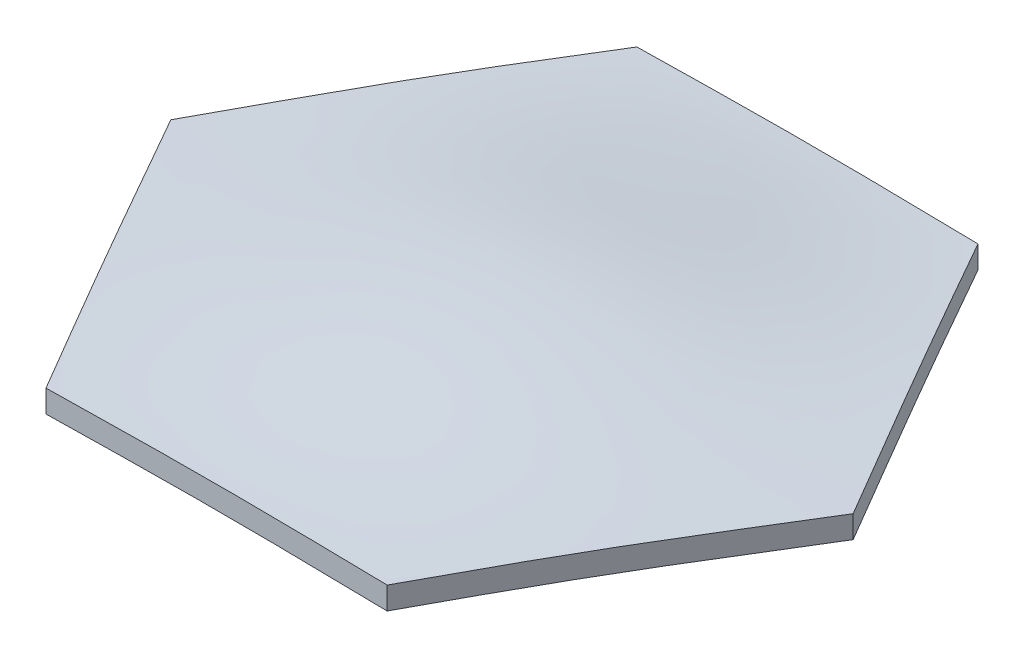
ISO-10303-21;
HEADER;
FILE_DESCRIPTION(('STEP AP214'),'2;1');
FILE_NAME('part.step','',(''),(''),'','','');
FILE_SCHEMA(('AUTOMOTIVE_DESIGN { 1 0 10303 214 1 1 1 1 }'));
ENDSEC;
DATA;
#1=APPLICATION_CONTEXT('core data for automotive mechanical design processes');
#2=APPLICATION_PROTOCOL_DEFINITION('international standard','automotive_design',2000,#1);
#3=PRODUCT_CONTEXT('',#1,'mechanical');
#4=PRODUCT('Part','Part','',(#3));
#5=PRODUCT_RELATED_PRODUCT_CATEGORY('part','',(#4));
#6=PRODUCT_DEFINITION_FORMATION('','',#4);
#7=PRODUCT_DEFINITION_CONTEXT('part definition',#1,'design');
#8=PRODUCT_DEFINITION('design','',#6,#7);
#9=PRODUCT_DEFINITION_SHAPE('','',#8);
#10=(LENGTH_UNIT() NAMED_UNIT(*) SI_UNIT(.MILLI.,.METRE.));
#11=(NAMED_UNIT(*) PLANE_ANGLE_UNIT() SI_UNIT($,.RADIAN.));
#12=(NAMED_UNIT(*) SI_UNIT($,.STERADIAN.) SOLID_ANGLE_UNIT());
#13=UNCERTAINTY_MEASURE_WITH_UNIT(LENGTH_MEASURE(1.E-05),#10,'distance_accuracy_value','');
#14=(GEOMETRIC_REPRESENTATION_CONTEXT(3) GLOBAL_UNCERTAINTY_ASSIGNED_CONTEXT((#13)) GLOBAL_UNIT_ASSIGNED_CONTEXT((#10,
#11,#12)) REPRESENTATION_CONTEXT('',''));
#15=CARTESIAN_POINT('',(0.,0.,0.));
#16=DIRECTION('',(0.,0.,1.));
#17=DIRECTION('',(1.,0.,0.));
#18=AXIS2_PLACEMENT_3D('',#15,#16,#17);
#19=CARTESIAN_POINT('',(27.4241377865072,3.61875921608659,47.5));
#20=DIRECTION('',(-0.866025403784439,0.,-0.5));
#21=DIRECTION('',(-0.5,0.,0.866025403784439));
#22=AXIS2_PLACEMENT_3D('',#19,#20,#21);
#23=PLANE('',#22);
#24=CARTESIAN_POINT('',(54.8482755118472,0.264362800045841,0.));
#25=CARTESIAN_POINT('',(53.9207386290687,0.297522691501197,1.60657472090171));
#26=CARTESIAN_POINT('',(52.9932859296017,0.333759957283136,3.2131276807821));
#27=CARTESIAN_POINT('',(51.3041317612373,0.401187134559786,6.13897251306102));
#28=CARTESIAN_POINT('',(50.5424388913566,0.432121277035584,7.45827511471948));
#29=CARTESIAN_POINT('',(49.1846606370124,0.48594003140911,9.80974240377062));
#30=CARTESIAN_POINT('',(48.5886059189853,0.509111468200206,10.8419181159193));
#31=CARTESIAN_POINT('',(47.6398664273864,0.544169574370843,12.4854343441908));
#32=CARTESIAN_POINT('',(47.2870820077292,0.55680404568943,13.0967012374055));
#33=CARTESIAN_POINT('',(46.1724388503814,0.595031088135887,15.0277929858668));
#34=CARTESIAN_POINT('',(45.4104417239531,0.618666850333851,16.3475770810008));
#35=CARTESIAN_POINT('',(43.4778169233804,0.669114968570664,19.6947418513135));
#36=CARTESIAN_POINT('',(42.3071164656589,0.69083764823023,21.7221658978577));
#37=CARTESIAN_POINT('',(40.3286777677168,0.707590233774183,25.1485427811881));
#38=CARTESIAN_POINT('',(39.5209379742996,0.708807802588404,26.5474647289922));
#39=CARTESIAN_POINT('',(37.923894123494,0.700084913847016,29.3132913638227));
#40=CARTESIAN_POINT('',(37.1345905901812,0.69039880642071,30.6801971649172));
#41=CARTESIAN_POINT('',(35.5744424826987,0.661078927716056,33.3822853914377));
#42=CARTESIAN_POINT('',(34.8035943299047,0.641681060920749,34.7174683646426));
#43=CARTESIAN_POINT('',(33.2802293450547,0.59512947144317,37.3561616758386));
#44=CARTESIAN_POINT('',(32.5277101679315,0.568170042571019,38.6596742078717));
#45=CARTESIAN_POINT('',(31.0409358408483,0.510321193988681,41.2350917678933));
#46=CARTESIAN_POINT('',(30.30667925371,0.479542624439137,42.5069985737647));
#47=CARTESIAN_POINT('',(28.8563462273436,0.41936309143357,45.0192605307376));
#48=CARTESIAN_POINT('',(28.140270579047,0.389946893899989,46.2596157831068));
#49=CARTESIAN_POINT('',(27.4241380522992,0.363162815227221,47.5));
#50=B_SPLINE_CURVE_WITH_KNOTS('',3,(#24,#25,#26,#27,#28,#29,#30,#31,#32,#33,#34,#35,#36,#37,#38,
#39,#40,#41,#42,#43,#44,#45,#46,#47,#48,#49),.UNSPECIFIED.,.F.,.F.,(4,2,2,2,2,2,2,2,2,2,2,2,4),
(0.,5.56618909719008,10.1373188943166,13.7137465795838,15.8313798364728,20.4038170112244,
27.4274664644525,32.2735442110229,37.0088781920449,41.6343955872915,46.1505098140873,
50.5573721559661,54.8549294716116),.UNSPECIFIED.);
#51=CARTESIAN_POINT('',(27.4241377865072,0.363147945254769,47.5));
#52=VERTEX_POINT('',#51);
#53=CARTESIAN_POINT('',(54.8482755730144,0.264364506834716,0.));
#54=VERTEX_POINT('',#53);
#55=EDGE_CURVE('E13',#52,#54,#50,.F.);
#56=ORIENTED_EDGE('',*,*,#55,.T.);
#57=DIRECTION('',(6.21263115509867E-13,-1.,0.));
#58=VECTOR('',#57,1.);
#59=CARTESIAN_POINT('',(54.8482755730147,2.07374411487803,0.));
#60=LINE('',#59,#58);
#61=CARTESIAN_POINT('',(54.8482755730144,3.8831237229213,0.));
#62=VERTEX_POINT('',#61);
#63=EDGE_CURVE('E185',#62,#54,#60,.T.);
#64=ORIENTED_EDGE('',*,*,#63,.F.);
#65=CARTESIAN_POINT('',(27.4241380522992,3.9819220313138,47.5000000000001));
#66=CARTESIAN_POINT('',(28.1402686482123,4.00870603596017,46.2596191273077));
#67=CARTESIAN_POINT('',(28.8563423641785,4.03812214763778,45.0192672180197));
#68=CARTESIAN_POINT('',(30.3066722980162,4.09830155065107,42.5070106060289));
#69=CARTESIAN_POINT('',(31.0409277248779,4.12908007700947,41.2351058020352));
#70=CARTESIAN_POINT('',(32.5277005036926,4.18692890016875,38.659690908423));
#71=CARTESIAN_POINT('',(33.2802192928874,4.21388834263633,37.356179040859));
#72=CARTESIAN_POINT('',(34.8035842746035,4.2604400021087,34.7174857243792));
#73=CARTESIAN_POINT('',(35.574432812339,4.2798379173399,33.3823020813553));
#74=CARTESIAN_POINT('',(37.1345824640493,4.30915789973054,30.6802111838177));
#75=CARTESIAN_POINT('',(37.9238871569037,4.31884405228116,29.3133033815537));
#76=CARTESIAN_POINT('',(39.5209341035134,4.32756700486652,26.5474714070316));
#77=CARTESIAN_POINT('',(40.3286758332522,4.32634944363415,25.148546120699));
#78=CARTESIAN_POINT('',(42.3070825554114,4.30959713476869,21.7222246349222));
#79=CARTESIAN_POINT('',(43.477749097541,4.28787544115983,19.6948593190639));
#80=CARTESIAN_POINT('',(45.4103399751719,4.23742905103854,16.347753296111));
#81=CARTESIAN_POINT('',(46.1723370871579,4.21379357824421,15.0279692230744));
#82=CARTESIAN_POINT('',(47.2870141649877,4.17556570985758,13.096818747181));
#83=CARTESIAN_POINT('',(47.639832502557,4.16293006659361,12.485493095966));
#84=CARTESIAN_POINT('',(48.5885672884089,4.12787214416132,10.8419850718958));
#85=CARTESIAN_POINT('',(49.1845833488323,4.10470228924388,9.80987629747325));
#86=CARTESIAN_POINT('',(50.5423229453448,4.05088521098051,7.45847596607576));
#87=CARTESIAN_POINT('',(51.3040158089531,4.01995107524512,6.13917338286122));
#88=CARTESIAN_POINT('',(52.9932086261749,3.95252221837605,3.21326161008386));
#89=CARTESIAN_POINT('',(53.9206999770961,3.91628329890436,1.60664168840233));
#90=CARTESIAN_POINT('',(54.8482755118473,3.88312201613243,0.));
#91=B_SPLINE_CURVE_WITH_KNOTS('',3,(#65,#66,#67,#68,#69,#70,#71,#72,#73,#74,#75,#76,#77,#78,#79,
#80,#81,#82,#83,#84,#85,#86,#87,#88,#89,#90),.UNSPECIFIED.,.F.,.F.,(4,2,2,2,2,2,2,2,2,2,2,2,4),
(0.,4.29754572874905,8.70440112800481,13.2205130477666,17.8460327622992,22.5813736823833,
27.4274630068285,34.4509089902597,39.0233460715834,41.1411828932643,44.717378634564,
49.288508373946,54.8549294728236),.UNSPECIFIED.);
#92=CARTESIAN_POINT('',(27.4241377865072,3.98190716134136,47.5));
#93=VERTEX_POINT('',#92);
#94=EDGE_CURVE('E242',#93,#62,#91,.T.);
#95=ORIENTED_EDGE('',*,*,#94,.F.);
#96=DIRECTION('',(3.10631557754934E-13,-1.,4.08422974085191E-13));
#97=VECTOR('',#96,1.);
#98=CARTESIAN_POINT('',(27.4241377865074,2.17252755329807,47.5000000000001));
#99=LINE('',#98,#97);
#100=EDGE_CURVE('E178',#93,#52,#99,.T.);
#101=ORIENTED_EDGE('',*,*,#100,.T.);
#102=EDGE_LOOP('',(#56,#64,#95,#101));
#103=FACE_BOUND('',#102,.T.);
#104=ADVANCED_FACE('F164',(#103),#23,.F.);
#105=CARTESIAN_POINT('',(54.8482755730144,3.61875921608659,0.));
#106=DIRECTION('',(-0.866025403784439,0.,0.5));
#107=DIRECTION('',(0.5,0.,0.866025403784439));
#108=AXIS2_PLACEMENT_3D('',#105,#106,#107);
#109=PLANE('',#108);
#110=CARTESIAN_POINT('',(27.4241380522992,0.363162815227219,-47.4999999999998));
#111=CARTESIAN_POINT('',(28.1402687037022,0.389946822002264,-46.2596190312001));
#112=CARTESIAN_POINT('',(28.8563424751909,0.419362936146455,-45.0192670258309));
#113=CARTESIAN_POINT('',(30.3066724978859,0.479542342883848,-42.5070102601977));
#114=CARTESIAN_POINT('',(31.0409279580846,0.510320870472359,-41.2351053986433));
#115=CARTESIAN_POINT('',(32.527700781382,0.568169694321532,-38.65969042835));
#116=CARTESIAN_POINT('',(33.2802195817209,0.595129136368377,-37.3561785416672));
#117=CARTESIAN_POINT('',(34.8035845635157,0.641680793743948,-34.7174852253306));
#118=CARTESIAN_POINT('',(35.5744330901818,0.661078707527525,-33.3823016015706));
#119=CARTESIAN_POINT('',(37.1345826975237,0.690398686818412,-30.6802107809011));
#120=CARTESIAN_POINT('',(37.9238873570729,0.700084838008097,-29.3133030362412));
#121=CARTESIAN_POINT('',(39.5209342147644,0.70880778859,-26.5474712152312));
#122=CARTESIAN_POINT('',(40.3286758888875,0.70759022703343,-25.1485460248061));
#123=CARTESIAN_POINT('',(42.3070819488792,0.6908379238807,-21.7222256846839));
#124=CARTESIAN_POINT('',(43.4777478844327,0.669116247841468,-19.6948614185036));
#125=CARTESIAN_POINT('',(45.4103381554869,0.618669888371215,-16.3477564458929));
#126=CARTESIAN_POINT('',(46.1723352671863,0.595034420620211,-15.027972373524));
#127=CARTESIAN_POINT('',(47.2870129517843,0.556806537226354,-13.0968208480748));
#128=CARTESIAN_POINT('',(47.6398318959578,0.544170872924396,-12.4854941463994));
#129=CARTESIAN_POINT('',(48.5885671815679,0.509112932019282,-10.8419852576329));
#130=CARTESIAN_POINT('',(49.1845831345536,0.485943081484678,-9.80987666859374));
#131=CARTESIAN_POINT('',(50.5423226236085,0.43212600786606,-7.45847652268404));
#132=CARTESIAN_POINT('',(51.3040154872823,0.401191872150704,-6.1391739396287));
#133=CARTESIAN_POINT('',(52.9932084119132,0.333763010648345,-3.21326198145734));
#134=CARTESIAN_POINT('',(53.9206998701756,0.29752408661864,-1.60664187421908));
#135=CARTESIAN_POINT('',(54.8482755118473,0.26436280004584,0.));
#136=B_SPLINE_CURVE_WITH_KNOTS('',3,(#110,#111,#112,#113,#114,#115,#116,#117,#118,#119,#120,
#121,#122,#123,#124,#125,#126,#127,#128,#129,#130,#131,#132,#133,#134,#135),.UNSPECIFIED.,.F.,
.F.,(4,2,2,2,2,2,2,2,2,2,2,2,4),(0.,4.29754606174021,8.70440166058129,13.2205136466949,
17.8460332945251,22.5813740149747,27.4274630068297,34.4509053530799,39.0233424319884,
41.1411828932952,44.7173779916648,49.2885077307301,54.8549294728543),.UNSPECIFIED.);
#137=CARTESIAN_POINT('',(27.4241377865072,0.363147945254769,-47.5));
#138=VERTEX_POINT('',#137);
#139=EDGE_CURVE('E233',#54,#138,#136,.F.);
#140=ORIENTED_EDGE('',*,*,#139,.T.);
#141=DIRECTION('',(2.04211487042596E-13,-1.,-4.08422974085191E-13));
#142=VECTOR('',#141,1.);
#143=CARTESIAN_POINT('',(27.4241377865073,2.17252755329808,-47.5000000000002));
#144=LINE('',#143,#142);
#145=CARTESIAN_POINT('',(27.4241377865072,3.98190716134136,-47.5));
#146=VERTEX_POINT('',#145);
#147=EDGE_CURVE('E218',#146,#138,#144,.T.);
#148=ORIENTED_EDGE('',*,*,#147,.F.);
#149=CARTESIAN_POINT('',(54.8482755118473,3.88312201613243,0.));
#150=CARTESIAN_POINT('',(53.9207385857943,3.91628190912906,-1.60657479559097));
#151=CARTESIAN_POINT('',(52.9932858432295,3.95251917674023,-3.21312783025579));
#152=CARTESIAN_POINT('',(51.3041316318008,4.01994635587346,-6.13897273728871));
#153=CARTESIAN_POINT('',(50.5424387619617,4.05088049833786,-7.45827533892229));
#154=CARTESIAN_POINT('',(49.1846605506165,4.10469925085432,-9.8097425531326));
#155=CARTESIAN_POINT('',(48.5886058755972,4.12787068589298,-10.8419181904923));
#156=CARTESIAN_POINT('',(47.6398668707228,4.16292877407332,-12.4854335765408));
#157=CARTESIAN_POINT('',(47.2870828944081,4.17556323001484,-13.0966997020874));
#158=CARTESIAN_POINT('',(46.1724401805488,4.21379026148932,-15.0277906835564));
#159=CARTESIAN_POINT('',(45.4104430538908,4.2374260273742,-16.3475747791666));
#160=CARTESIAN_POINT('',(43.4778178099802,4.28787416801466,-19.6947403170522));
#161=CARTESIAN_POINT('',(42.3071169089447,4.30959686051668,-21.7221651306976));
#162=CARTESIAN_POINT('',(40.3286777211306,4.32634945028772,-25.1485428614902));
#163=CARTESIAN_POINT('',(39.5209378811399,4.32756701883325,-26.5474648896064));
#164=CARTESIAN_POINT('',(37.9238939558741,4.31884412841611,-29.3132916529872));
#165=CARTESIAN_POINT('',(37.1345903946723,4.30915801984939,-30.6801975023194));
#166=CARTESIAN_POINT('',(35.5744422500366,4.27983813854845,-33.382285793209));
#167=CARTESIAN_POINT('',(34.8035940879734,4.2604402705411,-34.7174687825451));
#168=CARTESIAN_POINT('',(33.2802291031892,4.2138886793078,-37.3561620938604));
#169=CARTESIAN_POINT('',(32.527709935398,4.1869292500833,-38.6596746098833));
#170=CARTESIAN_POINT('',(31.0409356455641,4.12908040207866,-41.2350921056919));
#171=CARTESIAN_POINT('',(30.3066790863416,4.09830183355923,-42.5069988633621));
#172=CARTESIAN_POINT('',(28.8563461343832,4.03812230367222,-45.0192606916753));
#173=CARTESIAN_POINT('',(28.1402705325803,4.00870610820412,-46.2596158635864));
#174=CARTESIAN_POINT('',(27.4241380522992,3.9819220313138,-47.4999999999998));
#175=B_SPLINE_CURVE_WITH_KNOTS('',3,(#149,#150,#151,#152,#153,#154,#155,#156,#157,#158,#159,
#160,#161,#162,#163,#164,#165,#166,#167,#168,#169,#170,#171,#172,#173,#174),.UNSPECIFIED.,.F.,
.F.,(4,2,2,2,2,2,2,2,2,2,2,2,4),(0.,5.56618935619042,10.1373191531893,13.7137465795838,
15.8313771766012,20.4038143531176,27.4274664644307,32.2735444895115,37.0088786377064,
41.6343960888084,46.1505102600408,50.5573724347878,54.8549294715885),.UNSPECIFIED.);
#176=EDGE_CURVE('E191',#62,#146,#175,.T.);
#177=ORIENTED_EDGE('',*,*,#176,.F.);
#178=ORIENTED_EDGE('',*,*,#63,.T.);
#179=EDGE_LOOP('',(#140,#148,#177,#178));
#180=FACE_BOUND('',#179,.T.);
#181=ADVANCED_FACE('F232',(#180),#109,.F.);
#182=CARTESIAN_POINT('',(27.4241377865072,3.61875921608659,-47.5));
#183=DIRECTION('',(0.,0.,1.));
#184=DIRECTION('',(1.,0.,0.));
#185=AXIS2_PLACEMENT_3D('',#182,#183,#184);
#186=PLANE('',#185);
#187=CARTESIAN_POINT('',(-54.8482755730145,0.0352714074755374,-47.5000005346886));
#188=CARTESIAN_POINT('',(-49.2180144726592,0.0623830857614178,-47.5000005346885));
#189=CARTESIAN_POINT('',(-40.7698274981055,0.136478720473,-47.5000005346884));
#190=CARTESIAN_POINT('',(-26.71903010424,0.369822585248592,-47.5000005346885));
#191=CARTESIAN_POINT('',(-15.4866202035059,0.588191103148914,-47.5000005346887));
#192=CARTESIAN_POINT('',(-4.22371880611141,0.697953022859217,-47.5000005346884));
#193=CARTESIAN_POINT('',(4.22369685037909,0.697955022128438,-47.5000005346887));
#194=CARTESIAN_POINT('',(15.4866284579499,0.588190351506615,-47.5000005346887));
#195=CARTESIAN_POINT('',(26.7190301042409,0.369822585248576,-47.5000005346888));
#196=CARTESIAN_POINT('',(40.7698274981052,0.136478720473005,-47.5000005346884));
#197=CARTESIAN_POINT('',(49.2180144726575,0.0623830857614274,-47.5000005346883));
#198=CARTESIAN_POINT('',(54.8482755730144,0.0352714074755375,-47.5000005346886));
#199=B_SPLINE_CURVE_WITH_KNOTS('',3,(#187,#188,#189,#190,#191,#192,#193,#194,#195,#196,#197,
#198),.UNSPECIFIED.,.F.,.F.,(4,1,1,1,1,1,1,1,1,4),(0.,0.1537006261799,0.230710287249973,
0.384765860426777,0.46161470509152,0.538385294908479,0.615234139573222,0.769289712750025,
0.846299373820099,1.),.UNSPECIFIED.);
#200=CARTESIAN_POINT('',(-27.4241377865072,0.363147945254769,-47.5));
#201=VERTEX_POINT('',#200);
#202=EDGE_CURVE('E235',#138,#201,#199,.F.);
#203=ORIENTED_EDGE('',*,*,#202,.T.);
#204=DIRECTION('',(0.,-1.,0.));
#205=VECTOR('',#204,1.);
#206=CARTESIAN_POINT('',(-27.4241377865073,2.17252755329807,-47.4999999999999));
#207=LINE('',#206,#205);
#208=CARTESIAN_POINT('',(-27.4241377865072,3.98190716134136,-47.5));
#209=VERTEX_POINT('',#208);
#210=EDGE_CURVE('E225',#209,#201,#207,.T.);
#211=ORIENTED_EDGE('',*,*,#210,.F.);
#212=CARTESIAN_POINT('',(54.8482755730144,3.65403062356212,-47.5000005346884));
#213=CARTESIAN_POINT('',(49.2180144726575,3.681142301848,-47.5000005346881));
#214=CARTESIAN_POINT('',(40.7698274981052,3.75523793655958,-47.5000005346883));
#215=CARTESIAN_POINT('',(26.7190301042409,3.98858180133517,-47.5000005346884));
#216=CARTESIAN_POINT('',(15.4866284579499,4.20694956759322,-47.5000005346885));
#217=CARTESIAN_POINT('',(4.2236968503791,4.31671423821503,-47.5000005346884));
#218=CARTESIAN_POINT('',(-4.22371880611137,4.31671223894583,-47.5000005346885));
#219=CARTESIAN_POINT('',(-15.4866202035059,4.20695031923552,-47.5000005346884));
#220=CARTESIAN_POINT('',(-26.71903010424,3.98858180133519,-47.5000005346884));
#221=CARTESIAN_POINT('',(-40.7698274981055,3.75523793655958,-47.5000005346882));
#222=CARTESIAN_POINT('',(-49.2180144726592,3.68114230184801,-47.5000005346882));
#223=CARTESIAN_POINT('',(-54.8482755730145,3.65403062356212,-47.5000005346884));
#224=B_SPLINE_CURVE_WITH_KNOTS('',3,(#212,#213,#214,#215,#216,#217,#218,#219,#220,#221,#222,
#223),.UNSPECIFIED.,.F.,.F.,(4,1,1,1,1,1,1,1,1,4),(0.,0.153700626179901,0.230710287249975,
0.384765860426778,0.461614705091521,0.53838529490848,0.615234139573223,0.769289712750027,
0.8462993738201,1.),.UNSPECIFIED.);
#225=EDGE_CURVE('E222',#146,#209,#224,.T.);
#226=ORIENTED_EDGE('',*,*,#225,.F.);
#227=ORIENTED_EDGE('',*,*,#147,.T.);
#228=EDGE_LOOP('',(#203,#211,#226,#227));
#229=FACE_BOUND('',#228,.T.);
#230=ADVANCED_FACE('F224',(#229),#186,.F.);
#231=CARTESIAN_POINT('',(-27.4241377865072,3.61875921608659,-47.5));
#232=DIRECTION('',(0.866025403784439,0.,0.5));
#233=DIRECTION('',(0.5,0.,-0.866025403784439));
#234=AXIS2_PLACEMENT_3D('',#231,#232,#233);
#235=PLANE('',#234);
#236=CARTESIAN_POINT('',(-54.8482755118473,0.264362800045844,0.));
#237=CARTESIAN_POINT('',(-53.9207045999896,0.297523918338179,-1.60663367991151));
#238=CARTESIAN_POINT('',(-52.9932178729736,0.333762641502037,-3.21324559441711));
#239=CARTESIAN_POINT('',(-51.3040296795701,0.401191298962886,-6.13914936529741));
#240=CARTESIAN_POINT('',(-50.5423368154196,0.432125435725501,-7.458451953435));
#241=CARTESIAN_POINT('',(-49.184592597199,0.485942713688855,-9.80986029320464));
#242=CARTESIAN_POINT('',(-48.5885719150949,0.509112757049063,-10.8419770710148));
#243=CARTESIAN_POINT('',(-47.6398246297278,0.544171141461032,-12.4855067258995));
#244=CARTESIAN_POINT('',(-47.2869984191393,0.556807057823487,-13.0968460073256));
#245=CARTESIAN_POINT('',(-46.1723134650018,0.59503512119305,-15.0280101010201));
#246=CARTESIAN_POINT('',(-45.4103163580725,0.61867052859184,-16.3477941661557));
#247=CARTESIAN_POINT('',(-43.477733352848,0.669116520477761,-19.6948865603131));
#248=CARTESIAN_POINT('',(-42.3070746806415,0.690837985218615,-21.7222382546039));
#249=CARTESIAN_POINT('',(-40.328686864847,0.707590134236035,-25.1485270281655));
#250=CARTESIAN_POINT('',(-39.5209561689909,0.708807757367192,-26.5474332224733));
#251=CARTESIAN_POINT('',(-37.9239268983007,0.70008520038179,-29.31323465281));
#252=CARTESIAN_POINT('',(-37.1346288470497,0.6903993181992,-30.6801310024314));
#253=CARTESIAN_POINT('',(-35.5744880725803,0.66107995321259,-33.3822066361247));
#254=CARTESIAN_POINT('',(-34.803641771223,0.641682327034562,-34.7173864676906));
#255=CARTESIAN_POINT('',(-33.2802768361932,0.595131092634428,-37.3560798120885));
#256=CARTESIAN_POINT('',(-32.5277558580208,0.56817174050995,-38.6595955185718));
#257=CARTESIAN_POINT('',(-31.0409742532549,0.510322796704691,-41.2350257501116));
#258=CARTESIAN_POINT('',(-30.3067121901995,0.479544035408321,-42.5069420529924));
#259=CARTESIAN_POINT('',(-28.8563645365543,0.419363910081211,-45.0192293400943));
#260=CARTESIAN_POINT('',(-28.1402797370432,0.38994731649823,-46.2596004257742));
#261=CARTESIAN_POINT('',(-27.4241380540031,0.36316289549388,-47.5000004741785));
#262=B_SPLINE_CURVE_WITH_KNOTS('',3,(#236,#237,#238,#239,#240,#241,#242,#243,#244,#245,#246,
#247,#248,#249,#250,#251,#252,#253,#254,#255,#256,#257,#258,#259,#260,#261),.UNSPECIFIED.,.F.,
.F.,(4,2,2,2,2,2,2,2,2,2,2,2,4),(0.,5.56639335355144,10.1375231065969,13.7137465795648,
15.8316306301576,20.4040676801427,27.4274664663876,32.2734896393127,37.008790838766,
41.634297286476,46.1504224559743,50.5573176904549,54.8549298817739),.UNSPECIFIED.);
#263=CARTESIAN_POINT('',(-54.8482755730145,0.264364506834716,0.));
#264=VERTEX_POINT('',#263);
#265=EDGE_CURVE('E236',#201,#264,#262,.F.);
#266=ORIENTED_EDGE('',*,*,#265,.T.);
#267=DIRECTION('',(-5.06214390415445E-13,-1.,0.));
#268=VECTOR('',#267,1.);
#269=CARTESIAN_POINT('',(-54.8482755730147,2.07374411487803,0.));
#270=LINE('',#269,#268);
#271=CARTESIAN_POINT('',(-54.8482755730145,3.8831237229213,0.));
#272=VERTEX_POINT('',#271);
#273=EDGE_CURVE('E374',#272,#264,#270,.T.);
#274=ORIENTED_EDGE('',*,*,#273,.F.);
#275=CARTESIAN_POINT('',(-27.4241380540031,3.98192211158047,-47.5000004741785));
#276=CARTESIAN_POINT('',(-28.1402796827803,4.00870653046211,-46.2596005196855));
#277=CARTESIAN_POINT('',(-28.8563644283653,4.03812312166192,-45.019229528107));
#278=CARTESIAN_POINT('',(-30.3067119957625,4.09830324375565,-42.5069423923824));
#279=CARTESIAN_POINT('',(-31.0409740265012,4.1290820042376,-41.2350261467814));
#280=CARTESIAN_POINT('',(-32.5277555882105,4.18693094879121,-38.6595959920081));
#281=CARTESIAN_POINT('',(-33.2802765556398,4.21389030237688,-37.3560803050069));
#282=CARTESIAN_POINT('',(-34.8036414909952,4.2604415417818,-34.7173869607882));
#283=CARTESIAN_POINT('',(-35.5744878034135,4.27983917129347,-33.3822071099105));
#284=CARTESIAN_POINT('',(-37.1346286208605,4.30915854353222,-30.6801313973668));
#285=CARTESIAN_POINT('',(-37.9239267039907,4.31884442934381,-29.3132349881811));
#286=CARTESIAN_POINT('',(-39.5209560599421,4.32756699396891,-26.547433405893));
#287=CARTESIAN_POINT('',(-40.3286868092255,4.32634937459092,-25.1485271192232));
#288=CARTESIAN_POINT('',(-42.3071243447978,4.30959679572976,-21.7221522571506));
#289=CARTESIAN_POINT('',(-43.4778326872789,4.28787388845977,-19.6947145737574));
#290=CARTESIAN_POINT('',(-45.4104653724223,4.2374253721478,-16.3475361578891));
#291=CARTESIAN_POINT('',(-46.1724625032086,4.21378954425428,-15.0277520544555));
#292=CARTESIAN_POINT('',(-47.2870977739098,4.1755626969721,-13.0966739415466));
#293=CARTESIAN_POINT('',(-47.6398743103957,4.16292849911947,-12.485420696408));
#294=CARTESIAN_POINT('',(-48.5886016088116,4.12787084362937,-10.8419255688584));
#295=CARTESIAN_POINT('',(-49.1846520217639,4.10469958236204,-9.80975731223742));
#296=CARTESIAN_POINT('',(-50.5424259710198,4.05088101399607,-7.45829748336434));
#297=CARTESIAN_POINT('',(-51.3041188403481,4.0199468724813,-6.13899488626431));
#298=CARTESIAN_POINT('',(-52.9932773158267,3.95251950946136,-3.2131425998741));
#299=CARTESIAN_POINT('',(-53.9207343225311,3.91628206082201,-1.60658218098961));
#300=CARTESIAN_POINT('',(-54.8482755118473,3.88312201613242,0.));
#301=B_SPLINE_CURVE_WITH_KNOTS('',3,(#275,#276,#277,#278,#279,#280,#281,#282,#283,#284,#285,
#286,#287,#288,#289,#290,#291,#292,#293,#294,#295,#296,#297,#298,#299,#300),.UNSPECIFIED.,.F.,
.F.,(4,2,2,2,2,2,2,2,2,2,2,2,4),(0.,4.29761186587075,8.70450690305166,13.2206320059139,
17.8461385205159,22.581439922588,27.4274634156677,34.4511601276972,39.0235973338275,
41.1411833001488,44.7175851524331,49.2887149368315,54.8549298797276),.UNSPECIFIED.);
#302=EDGE_CURVE('E229',#209,#272,#301,.T.);
#303=ORIENTED_EDGE('',*,*,#302,.F.);
#304=ORIENTED_EDGE('',*,*,#210,.T.);
#305=EDGE_LOOP('',(#266,#274,#303,#304));
#306=FACE_BOUND('',#305,.T.);
#307=ADVANCED_FACE('F316',(#306),#235,.F.);
#308=CARTESIAN_POINT('',(-54.8482755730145,3.61875921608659,0.));
#309=DIRECTION('',(0.866025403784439,0.,-0.5));
#310=DIRECTION('',(-0.5,0.,-0.866025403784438));
#311=AXIS2_PLACEMENT_3D('',#308,#309,#310);
#312=PLANE('',#311);
#313=CARTESIAN_POINT('',(-27.4241380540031,0.363162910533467,47.5000000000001));
#314=CARTESIAN_POINT('',(-28.1402853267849,0.389947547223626,46.2595902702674));
#315=CARTESIAN_POINT('',(-28.8563757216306,0.419364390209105,45.0192095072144));
#316=CARTESIAN_POINT('',(-30.3067323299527,0.479544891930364,42.506906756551));
#317=CARTESIAN_POINT('',(-31.0409977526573,0.510323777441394,41.2349846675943));
#318=CARTESIAN_POINT('',(-32.5277838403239,0.56817279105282,38.6595467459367));
#319=CARTESIAN_POINT('',(-33.2803059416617,0.595132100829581,37.3560291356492));
#320=CARTESIAN_POINT('',(-34.8036708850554,0.641683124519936,34.7173358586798));
#321=CARTESIAN_POINT('',(-35.5745160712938,0.661080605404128,33.3821579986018));
#322=CARTESIAN_POINT('',(-37.1346523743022,0.690399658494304,30.6800901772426));
#323=CARTESIAN_POINT('',(-37.923947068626,0.700085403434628,29.3131996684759));
#324=CARTESIAN_POINT('',(-39.5209673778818,0.708807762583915,26.5474137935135));
#325=CARTESIAN_POINT('',(-40.3286924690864,0.707590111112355,25.1485173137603));
#326=CARTESIAN_POINT('',(-42.3071243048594,0.690837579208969,21.7221523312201));
#327=CARTESIAN_POINT('',(-43.4778326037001,0.669114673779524,19.6947147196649));
#328=CARTESIAN_POINT('',(-45.4104652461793,0.618666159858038,16.3475363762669));
#329=CARTESIAN_POINT('',(-46.1724623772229,0.595030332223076,15.0277522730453));
#330=CARTESIAN_POINT('',(-47.2870976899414,0.556803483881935,13.096674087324));
#331=CARTESIAN_POINT('',(-47.6398742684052,0.544169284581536,12.485420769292));
#332=CARTESIAN_POINT('',(-48.5886013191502,0.509111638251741,10.8419260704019));
#333=CARTESIAN_POINT('',(-49.1846514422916,0.485940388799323,9.80975831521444));
#334=CARTESIAN_POINT('',(-50.5424251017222,0.432121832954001,7.45829898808));
#335=CARTESIAN_POINT('',(-51.3041179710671,0.401187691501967,6.1389963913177));
#336=CARTESIAN_POINT('',(-52.9932767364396,0.333760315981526,3.21314360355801));
#337=CARTESIAN_POINT('',(-53.9207340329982,0.297522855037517,1.60658268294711));
#338=CARTESIAN_POINT('',(-54.8482755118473,0.264362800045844,0.));
#339=B_SPLINE_CURVE_WITH_KNOTS('',3,(#313,#314,#315,#316,#317,#318,#319,#320,#321,#322,#323,
#324,#325,#326,#327,#328,#329,#330,#331,#332,#333,#334,#335,#336,#337,#338),.UNSPECIFIED.,.F.,
.F.,(4,2,2,2,2,2,2,2,2,2,2,2,4),(0.,4.29764573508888,8.70456104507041,13.22069284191,
17.846192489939,22.5814734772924,27.4274630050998,34.4511594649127,39.0235966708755,
41.1411828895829,44.7175830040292,49.2887127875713,54.8549294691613),.UNSPECIFIED.);
#340=CARTESIAN_POINT('',(-27.4241377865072,0.363147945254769,47.5));
#341=VERTEX_POINT('',#340);
#342=EDGE_CURVE('E337',#264,#341,#339,.F.);
#343=ORIENTED_EDGE('',*,*,#342,.T.);
#344=DIRECTION('',(-2.38726104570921E-13,-1.,2.70364503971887E-13));
#345=VECTOR('',#344,1.);
#346=CARTESIAN_POINT('',(-27.4241377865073,2.17252755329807,47.5000000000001));
#347=LINE('',#346,#345);
#348=CARTESIAN_POINT('',(-27.4241377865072,3.98190716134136,47.5));
#349=VERTEX_POINT('',#348);
#350=EDGE_CURVE('E342',#349,#341,#347,.T.);
#351=ORIENTED_EDGE('',*,*,#350,.F.);
#352=CARTESIAN_POINT('',(-54.8482755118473,3.88312201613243,0.));
#353=CARTESIAN_POINT('',(-53.9207045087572,3.91628313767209,1.60663383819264));
#354=CARTESIAN_POINT('',(-52.9932176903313,3.95252186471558,3.21324591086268));
#355=CARTESIAN_POINT('',(-51.3040294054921,4.01995052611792,6.13914983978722));
#356=CARTESIAN_POINT('',(-50.5423365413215,4.05088466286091,7.45845242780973));
#357=CARTESIAN_POINT('',(-49.1845924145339,4.10470193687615,9.80986060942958));
#358=CARTESIAN_POINT('',(-48.5885718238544,4.12787197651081,10.841977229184));
#359=CARTESIAN_POINT('',(-47.6398244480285,4.16293036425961,12.4855070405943));
#360=CARTESIAN_POINT('',(-47.2869980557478,4.17556628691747,13.0968466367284));
#361=CARTESIAN_POINT('',(-46.1723129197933,4.21379435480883,15.0280110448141));
#362=CARTESIAN_POINT('',(-45.4103158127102,4.23742976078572,16.3477951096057));
#363=CARTESIAN_POINT('',(-43.4777329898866,4.28787574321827,19.6948871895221));
#364=CARTESIAN_POINT('',(-42.3070745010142,4.30959720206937,21.7222385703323));
#365=CARTESIAN_POINT('',(-40.3286925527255,4.32634930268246,25.148517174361));
#366=CARTESIAN_POINT('',(-39.5209675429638,4.32756695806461,26.5474135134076));
#367=CARTESIAN_POINT('',(-37.9239473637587,4.31884460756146,29.313199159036));
#368=CARTESIAN_POINT('',(-37.1346527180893,4.30915886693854,30.6800895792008));
#369=CARTESIAN_POINT('',(-35.5745164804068,4.27983982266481,33.3821572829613));
#370=CARTESIAN_POINT('',(-34.8036713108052,4.26044234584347,34.7173351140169));
#371=CARTESIAN_POINT('',(-33.280306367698,4.21389132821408,37.3560283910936));
#372=CARTESIAN_POINT('',(-32.5277842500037,4.18693202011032,38.6595460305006));
#373=CARTESIAN_POINT('',(-31.0409980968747,4.1290830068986,41.2349840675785));
#374=CARTESIAN_POINT('',(-30.3067326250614,4.09830411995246,42.5069062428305));
#375=CARTESIAN_POINT('',(-28.8563758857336,4.03812361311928,45.0192092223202));
#376=CARTESIAN_POINT('',(-28.1402854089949,4.0087067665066,46.2595901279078));
#377=CARTESIAN_POINT('',(-27.4241380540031,3.98192212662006,47.5000000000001));
#378=B_SPLINE_CURVE_WITH_KNOTS('',3,(#352,#353,#354,#355,#356,#357,#358,#359,#360,#361,#362,
#363,#364,#365,#366,#367,#368,#369,#370,#371,#372,#373,#374,#375,#376,#377),.UNSPECIFIED.,.F.,
.F.,(4,2,2,2,2,2,2,2,2,2,2,2,4),(0.,5.56639390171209,10.1375236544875,13.7137465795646,
15.8316317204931,20.4040687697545,27.4274664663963,32.2734555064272,37.0087361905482,
41.6342357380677,46.1503676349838,50.557283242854,54.8549294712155),.UNSPECIFIED.);
#379=EDGE_CURVE('E302',#272,#349,#378,.T.);
#380=ORIENTED_EDGE('',*,*,#379,.F.);
#381=ORIENTED_EDGE('',*,*,#273,.T.);
#382=EDGE_LOOP('',(#343,#351,#380,#381));
#383=FACE_BOUND('',#382,.T.);
#384=ADVANCED_FACE('F307',(#383),#312,.F.);
#385=CARTESIAN_POINT('',(-27.4241377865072,3.61875921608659,47.5));
#386=DIRECTION('',(0.,0.,-1.));
#387=DIRECTION('',(-1.,0.,0.));
#388=AXIS2_PLACEMENT_3D('',#385,#386,#387);
#389=PLANE('',#388);
#390=CARTESIAN_POINT('',(54.8482755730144,0.0352714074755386,47.5000005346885));
#391=CARTESIAN_POINT('',(49.2180144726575,0.0623830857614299,47.5000005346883));
#392=CARTESIAN_POINT('',(40.7698274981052,0.136478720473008,47.5000005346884));
#393=CARTESIAN_POINT('',(26.7190301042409,0.36982258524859,47.5000005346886));
#394=CARTESIAN_POINT('',(15.4866284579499,0.588190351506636,47.5000005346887));
#395=CARTESIAN_POINT('',(4.22369685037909,0.697955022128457,47.5000005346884));
#396=CARTESIAN_POINT('',(-4.22371880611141,0.697953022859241,47.5000005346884));
#397=CARTESIAN_POINT('',(-15.4866202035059,0.588191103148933,47.5000005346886));
#398=CARTESIAN_POINT('',(-26.71903010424,0.369822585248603,47.5000005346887));
#399=CARTESIAN_POINT('',(-40.7698274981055,0.136478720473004,47.5000005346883));
#400=CARTESIAN_POINT('',(-49.2180144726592,0.0623830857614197,47.5000005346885));
#401=CARTESIAN_POINT('',(-54.8482755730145,0.0352714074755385,47.5000005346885));
#402=B_SPLINE_CURVE_WITH_KNOTS('',3,(#390,#391,#392,#393,#394,#395,#396,#397,#398,#399,#400,
#401),.UNSPECIFIED.,.F.,.F.,(4,1,1,1,1,1,1,1,1,4),(0.,0.153700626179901,0.230710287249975,
0.384765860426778,0.461614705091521,0.53838529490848,0.615234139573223,0.769289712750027,
0.8462993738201,1.),.UNSPECIFIED.);
#403=EDGE_CURVE('E349',#341,#52,#402,.F.);
#404=ORIENTED_EDGE('',*,*,#403,.T.);
#405=ORIENTED_EDGE('',*,*,#100,.F.);
#406=CARTESIAN_POINT('',(-54.8482755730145,3.65403062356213,47.5000005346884));
#407=CARTESIAN_POINT('',(-49.2180144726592,3.68114230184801,47.5000005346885));
#408=CARTESIAN_POINT('',(-40.7698274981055,3.75523793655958,47.5000005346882));
#409=CARTESIAN_POINT('',(-26.71903010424,3.98858180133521,47.5000005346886));
#410=CARTESIAN_POINT('',(-15.4866202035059,4.20695031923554,47.5000005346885));
#411=CARTESIAN_POINT('',(-4.22371880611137,4.31671223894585,47.5000005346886));
#412=CARTESIAN_POINT('',(4.2236968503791,4.31671423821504,47.5000005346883));
#413=CARTESIAN_POINT('',(15.4866284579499,4.20694956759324,47.5000005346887));
#414=CARTESIAN_POINT('',(26.7190301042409,3.98858180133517,47.5000005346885));
#415=CARTESIAN_POINT('',(40.7698274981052,3.75523793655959,47.5000005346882));
#416=CARTESIAN_POINT('',(49.2180144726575,3.681142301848,47.5000005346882));
#417=CARTESIAN_POINT('',(54.8482755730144,3.65403062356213,47.5000005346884));
#418=B_SPLINE_CURVE_WITH_KNOTS('',3,(#406,#407,#408,#409,#410,#411,#412,#413,#414,#415,#416,
#417),.UNSPECIFIED.,.F.,.F.,(4,1,1,1,1,1,1,1,1,4),(0.,0.1537006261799,0.230710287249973,
0.384765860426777,0.46161470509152,0.538385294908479,0.615234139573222,0.769289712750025,
0.846299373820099,1.),.UNSPECIFIED.);
#419=EDGE_CURVE('E432',#349,#93,#418,.T.);
#420=ORIENTED_EDGE('',*,*,#419,.F.);
#421=ORIENTED_EDGE('',*,*,#350,.T.);
#422=EDGE_LOOP('',(#404,#405,#420,#421));
#423=FACE_BOUND('',#422,.T.);
#424=ADVANCED_FACE('F262',(#423),#389,.F.);
#425=CARTESIAN_POINT('',(-54.8482755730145,3.65402875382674,47.5005999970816));
#426=CARTESIAN_POINT('',(-49.2180144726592,3.68113901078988,47.5005999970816));
#427=CARTESIAN_POINT('',(-40.7698274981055,3.7552307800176,47.5005999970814));
#428=CARTESIAN_POINT('',(-26.71903010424,3.98856241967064,47.5005999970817));
#429=CARTESIAN_POINT('',(-15.4866202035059,4.20691961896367,47.5005999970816));
#430=CARTESIAN_POINT('',(-4.22371880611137,4.31667578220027,47.5005999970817));
#431=CARTESIAN_POINT('',(4.2236968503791,4.31667778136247,47.5005999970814));
#432=CARTESIAN_POINT('',(15.4866284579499,4.20691886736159,47.5005999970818));
#433=CARTESIAN_POINT('',(26.7190301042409,3.98856241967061,47.5005999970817));
#434=CARTESIAN_POINT('',(40.7698274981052,3.7552307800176,47.5005999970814));
#435=CARTESIAN_POINT('',(49.2180144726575,3.68113901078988,47.5005999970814));
#436=CARTESIAN_POINT('',(54.8482755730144,3.65402875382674,47.5005999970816));
#437=CARTESIAN_POINT('',(-54.8482755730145,3.65402937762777,47.5003999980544));
#438=CARTESIAN_POINT('',(-49.2180144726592,3.68114010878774,47.5003999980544));
#439=CARTESIAN_POINT('',(-40.7698274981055,3.75523316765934,47.5003999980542));
#440=CARTESIAN_POINT('',(-26.71903010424,3.98856888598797,47.5003999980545));
#441=CARTESIAN_POINT('',(-15.4866202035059,4.20692986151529,47.5003999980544));
#442=CARTESIAN_POINT('',(-4.22371880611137,4.31668794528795,47.5003999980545));
#443=CARTESIAN_POINT('',(4.2236968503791,4.31668994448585,47.5003999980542));
#444=CARTESIAN_POINT('',(15.4866284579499,4.20692910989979,47.5003999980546));
#445=CARTESIAN_POINT('',(26.7190301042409,3.98856888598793,47.5003999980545));
#446=CARTESIAN_POINT('',(40.7698274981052,3.75523316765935,47.5003999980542));
#447=CARTESIAN_POINT('',(49.2180144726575,3.68114010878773,47.5003999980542));
#448=CARTESIAN_POINT('',(54.8482755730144,3.65402937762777,47.5003999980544));
#449=CARTESIAN_POINT('',(-54.8482755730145,3.6540300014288,47.5001999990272));
#450=CARTESIAN_POINT('',(-49.2180144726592,3.6811412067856,47.5001999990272));
#451=CARTESIAN_POINT('',(-40.7698274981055,3.75523555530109,47.500199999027));
#452=CARTESIAN_POINT('',(-26.71903010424,3.98857535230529,47.5001999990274));
#453=CARTESIAN_POINT('',(-15.4866202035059,4.20694010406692,47.5001999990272));
#454=CARTESIAN_POINT('',(-4.22371880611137,4.31670010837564,47.5001999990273));
#455=CARTESIAN_POINT('',(4.2236968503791,4.31670210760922,47.5001999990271));
#456=CARTESIAN_POINT('',(15.4866284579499,4.206939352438,47.5001999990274));
#457=CARTESIAN_POINT('',(26.7190301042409,3.98857535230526,47.5001999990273));
#458=CARTESIAN_POINT('',(40.7698274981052,3.7552355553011,47.500199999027));
#459=CARTESIAN_POINT('',(49.2180144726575,3.68114120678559,47.500199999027));
#460=CARTESIAN_POINT('',(54.8482755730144,3.6540300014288,47.5001999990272));
#461=CARTESIAN_POINT('',(-54.8482755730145,3.65403062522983,47.5));
#462=CARTESIAN_POINT('',(-49.2180144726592,3.68114230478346,47.5));
#463=CARTESIAN_POINT('',(-40.7698274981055,3.75523794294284,47.4999999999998));
#464=CARTESIAN_POINT('',(-26.71903010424,3.98858181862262,47.5000000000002));
#465=CARTESIAN_POINT('',(-15.4866202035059,4.20695034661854,47.5000000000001));
#466=CARTESIAN_POINT('',(-4.22371880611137,4.31671227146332,47.5000000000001));
#467=CARTESIAN_POINT('',(4.2236968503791,4.3167142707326,47.4999999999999));
#468=CARTESIAN_POINT('',(15.4866284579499,4.2069495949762,47.5000000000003));
#469=CARTESIAN_POINT('',(26.7190301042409,3.98858181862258,47.5000000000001));
#470=CARTESIAN_POINT('',(40.7698274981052,3.75523794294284,47.4999999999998));
#471=CARTESIAN_POINT('',(49.2180144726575,3.68114230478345,47.4999999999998));
#472=CARTESIAN_POINT('',(54.8482755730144,3.65403062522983,47.5));
#473=CARTESIAN_POINT('',(-54.8482755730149,3.67201158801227,41.7350607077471));
#474=CARTESIAN_POINT('',(-49.2180144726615,3.71279191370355,41.7350607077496));
#475=CARTESIAN_POINT('',(-40.7698274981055,3.82406132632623,41.7350607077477));
#476=CARTESIAN_POINT('',(-26.7190301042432,4.17497235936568,41.735060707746));
#477=CARTESIAN_POINT('',(-15.486620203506,4.50219022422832,41.735060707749));
#478=CARTESIAN_POINT('',(-4.22371880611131,4.66731128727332,41.7350607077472));
#479=CARTESIAN_POINT('',(4.22369685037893,4.66731431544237,41.7350607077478));
#480=CARTESIAN_POINT('',(15.4866284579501,4.5021890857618,41.7350607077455));
#481=CARTESIAN_POINT('',(26.7190301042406,4.17497235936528,41.7350607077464));
#482=CARTESIAN_POINT('',(40.7698274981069,3.82406132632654,41.7350607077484));
#483=CARTESIAN_POINT('',(49.2180144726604,3.71279191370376,41.7350607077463));
#484=CARTESIAN_POINT('',(54.8482755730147,3.67201158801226,41.7350607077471));
#485=CARTESIAN_POINT('',(-54.8482755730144,3.73767558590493,30.2180611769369));
#486=CARTESIAN_POINT('',(-49.218014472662,3.82894796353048,30.218061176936));
#487=CARTESIAN_POINT('',(-40.7698274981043,4.0782335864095,30.2180611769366));
#488=CARTESIAN_POINT('',(-26.7190301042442,4.86372722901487,30.2180611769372));
#489=CARTESIAN_POINT('',(-15.4866202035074,5.59778223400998,30.2180611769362));
#490=CARTESIAN_POINT('',(-4.22371880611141,5.96731825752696,30.2180611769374));
#491=CARTESIAN_POINT('',(4.22369685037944,5.96732500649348,30.2180611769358));
#492=CARTESIAN_POINT('',(15.4866284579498,5.59777969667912,30.218061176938));
#493=CARTESIAN_POINT('',(26.719030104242,4.86372722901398,30.218061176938));
#494=CARTESIAN_POINT('',(40.769827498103,4.07823358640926,30.218061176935));
#495=CARTESIAN_POINT('',(49.2180144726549,3.82894796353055,30.2180611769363));
#496=CARTESIAN_POINT('',(54.8482755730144,3.73767558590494,30.2180611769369));
#497=CARTESIAN_POINT('',(-54.8482755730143,3.84284033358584,15.8471935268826));
#498=CARTESIAN_POINT('',(-49.2180144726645,4.01373279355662,15.847193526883));
#499=CARTESIAN_POINT('',(-40.7698274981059,4.47916552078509,15.8471935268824));
#500=CARTESIAN_POINT('',(-26.7190301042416,5.94932756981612,15.8471935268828));
#501=CARTESIAN_POINT('',(-15.4866202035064,7.31476707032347,15.8471935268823));
#502=CARTESIAN_POINT('',(-4.22371880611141,8.00681698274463,15.8471935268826));
#503=CARTESIAN_POINT('',(4.22369685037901,8.00682976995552,15.8471935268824));
#504=CARTESIAN_POINT('',(15.4866284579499,7.31476226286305,15.8471935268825));
#505=CARTESIAN_POINT('',(26.7190301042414,5.94932756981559,15.8471935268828));
#506=CARTESIAN_POINT('',(40.7698274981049,4.47916552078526,15.8471935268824));
#507=CARTESIAN_POINT('',(49.2180144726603,4.01373279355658,15.8471935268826));
#508=CARTESIAN_POINT('',(54.8482755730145,3.84284033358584,15.8471935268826));
#509=CARTESIAN_POINT('',(-54.8482755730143,3.88441878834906,4.32198274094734));
#510=CARTESIAN_POINT('',(-49.2180144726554,4.08718791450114,4.32198274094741));
#511=CARTESIAN_POINT('',(-40.769827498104,4.6396397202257,4.32198274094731));
#512=CARTESIAN_POINT('',(-26.7190301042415,6.38411561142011,4.3219827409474));
#513=CARTESIAN_POINT('',(-15.486620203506,8.00562650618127,4.32198274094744));
#514=CARTESIAN_POINT('',(-4.22371880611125,8.82674112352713,4.32198274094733));
#515=CARTESIAN_POINT('',(4.22369685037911,8.82675627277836,4.32198274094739));
#516=CARTESIAN_POINT('',(15.4866284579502,8.00562081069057,4.32198274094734));
#517=CARTESIAN_POINT('',(26.7190301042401,6.3841156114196,4.32198274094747));
#518=CARTESIAN_POINT('',(40.7698274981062,4.63963972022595,4.32198274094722));
#519=CARTESIAN_POINT('',(49.2180144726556,4.08718791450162,4.32198274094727));
#520=CARTESIAN_POINT('',(54.8482755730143,3.88441878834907,4.32198274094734));
#521=CARTESIAN_POINT('',(-54.8482755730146,3.88441873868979,-4.3219837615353));
#522=CARTESIAN_POINT('',(-49.2180144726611,4.08718782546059,-4.32198376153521));
#523=CARTESIAN_POINT('',(-40.7698274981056,4.6396395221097,-4.32198376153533));
#524=CARTESIAN_POINT('',(-26.7190301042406,6.38411507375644,-4.3219837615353));
#525=CARTESIAN_POINT('',(-15.486620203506,8.00562564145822,-4.32198376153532));
#526=CARTESIAN_POINT('',(-4.22371880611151,8.82674009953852,-4.32198376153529));
#527=CARTESIAN_POINT('',(4.22369685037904,8.82675524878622,-4.32198376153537));
#528=CARTESIAN_POINT('',(15.4866284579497,8.00561994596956,-4.32198376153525));
#529=CARTESIAN_POINT('',(26.7190301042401,6.38411507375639,-4.32198376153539));
#530=CARTESIAN_POINT('',(40.769827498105,4.63963952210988,-4.32198376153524));
#531=CARTESIAN_POINT('',(49.2180144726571,4.08718782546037,-4.32198376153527));
#532=CARTESIAN_POINT('',(54.8482755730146,3.88441873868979,-4.3219837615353));
#533=CARTESIAN_POINT('',(-54.8482755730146,3.84284034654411,-15.847193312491));
#534=CARTESIAN_POINT('',(-49.2180144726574,4.01373281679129,-15.8471933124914));
#535=CARTESIAN_POINT('',(-40.7698274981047,4.47916557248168,-15.847193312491));
#536=CARTESIAN_POINT('',(-26.7190301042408,5.94932771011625,-15.8471933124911));
#537=CARTESIAN_POINT('',(-15.4866202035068,7.31476729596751,-15.847193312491));
#538=CARTESIAN_POINT('',(-4.22371880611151,8.00681724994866,-15.8471933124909));
#539=CARTESIAN_POINT('',(4.22369685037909,8.00683003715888,-15.8471933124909));
#540=CARTESIAN_POINT('',(15.4866284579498,7.3147624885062,-15.8471933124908));
#541=CARTESIAN_POINT('',(26.719030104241,5.94932771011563,-15.8471933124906));
#542=CARTESIAN_POINT('',(40.7698274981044,4.47916557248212,-15.8471933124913));
#543=CARTESIAN_POINT('',(49.2180144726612,4.01373281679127,-15.8471933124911));
#544=CARTESIAN_POINT('',(54.8482755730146,3.84284034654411,-15.847193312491));
#545=CARTESIAN_POINT('',(-54.8482755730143,3.73767558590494,-30.2180611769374));
#546=CARTESIAN_POINT('',(-49.2180144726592,3.82894796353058,-30.218061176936));
#547=CARTESIAN_POINT('',(-40.7698274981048,4.07823358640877,-30.2180611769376));
#548=CARTESIAN_POINT('',(-26.7190301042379,4.86372722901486,-30.2180611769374));
#549=CARTESIAN_POINT('',(-15.4866202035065,5.59778223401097,-30.2180611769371));
#550=CARTESIAN_POINT('',(-4.22371880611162,5.9673182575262,-30.2180611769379));
#551=CARTESIAN_POINT('',(4.22369685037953,5.96732500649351,-30.2180611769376));
#552=CARTESIAN_POINT('',(15.48662845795,5.59777969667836,-30.2180611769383));
#553=CARTESIAN_POINT('',(26.7190301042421,4.86372722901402,-30.2180611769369));
#554=CARTESIAN_POINT('',(40.769827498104,4.07823358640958,-30.218061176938));
#555=CARTESIAN_POINT('',(49.2180144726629,3.82894796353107,-30.2180611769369));
#556=CARTESIAN_POINT('',(54.8482755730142,3.73767558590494,-30.2180611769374));
#557=CARTESIAN_POINT('',(-54.8482755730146,3.67201158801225,-41.7350607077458));
#558=CARTESIAN_POINT('',(-49.2180144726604,3.71279191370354,-41.7350607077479));
#559=CARTESIAN_POINT('',(-40.7698274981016,3.82406132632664,-41.7350607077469));
#560=CARTESIAN_POINT('',(-26.7190301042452,4.17497235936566,-41.7350607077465));
#561=CARTESIAN_POINT('',(-15.4866202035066,4.50219022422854,-41.7350607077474));
#562=CARTESIAN_POINT('',(-4.22371880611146,4.66731128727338,-41.7350607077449));
#563=CARTESIAN_POINT('',(4.22369685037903,4.66731431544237,-41.7350607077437));
#564=CARTESIAN_POINT('',(15.4866284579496,4.50218908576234,-41.7350607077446));
#565=CARTESIAN_POINT('',(26.7190301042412,4.1749723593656,-41.7350607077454));
#566=CARTESIAN_POINT('',(40.7698274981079,3.82406132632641,-41.7350607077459));
#567=CARTESIAN_POINT('',(49.2180144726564,3.71279191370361,-41.735060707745));
#568=CARTESIAN_POINT('',(54.8482755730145,3.67201158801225,-41.7350607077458));
#569=CARTESIAN_POINT('',(-54.8482755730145,3.65403062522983,-47.4999999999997));
#570=CARTESIAN_POINT('',(-49.2180144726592,3.68114230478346,-47.4999999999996));
#571=CARTESIAN_POINT('',(-40.7698274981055,3.75523794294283,-47.4999999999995));
#572=CARTESIAN_POINT('',(-26.71903010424,3.98858181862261,-47.4999999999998));
#573=CARTESIAN_POINT('',(-15.4866202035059,4.20695034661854,-47.4999999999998));
#574=CARTESIAN_POINT('',(-4.22371880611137,4.31671227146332,-47.4999999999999));
#575=CARTESIAN_POINT('',(4.2236968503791,4.31671427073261,-47.4999999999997));
#576=CARTESIAN_POINT('',(15.4866284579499,4.2069495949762,-47.4999999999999));
#577=CARTESIAN_POINT('',(26.7190301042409,3.98858181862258,-47.4999999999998));
#578=CARTESIAN_POINT('',(40.7698274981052,3.75523794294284,-47.4999999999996));
#579=CARTESIAN_POINT('',(49.2180144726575,3.68114230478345,-47.4999999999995));
#580=CARTESIAN_POINT('',(54.8482755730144,3.65403062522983,-47.4999999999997));
#581=CARTESIAN_POINT('',(-54.8482755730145,3.6540300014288,-47.5001999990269));
#582=CARTESIAN_POINT('',(-49.2180144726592,3.6811412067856,-47.5001999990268));
#583=CARTESIAN_POINT('',(-40.7698274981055,3.75523555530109,-47.5001999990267));
#584=CARTESIAN_POINT('',(-26.71903010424,3.98857535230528,-47.500199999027));
#585=CARTESIAN_POINT('',(-15.4866202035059,4.20694010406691,-47.5001999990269));
#586=CARTESIAN_POINT('',(-4.22371880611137,4.31670010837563,-47.5001999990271));
#587=CARTESIAN_POINT('',(4.2236968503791,4.31670210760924,-47.5001999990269));
#588=CARTESIAN_POINT('',(15.4866284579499,4.20693935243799,-47.5001999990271));
#589=CARTESIAN_POINT('',(26.7190301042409,3.98857535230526,-47.500199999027));
#590=CARTESIAN_POINT('',(40.7698274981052,3.75523555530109,-47.5001999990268));
#591=CARTESIAN_POINT('',(49.2180144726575,3.68114120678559,-47.5001999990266));
#592=CARTESIAN_POINT('',(54.8482755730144,3.6540300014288,-47.5001999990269));
#593=CARTESIAN_POINT('',(-54.8482755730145,3.65402937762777,-47.5003999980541));
#594=CARTESIAN_POINT('',(-49.2180144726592,3.68114010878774,-47.500399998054));
#595=CARTESIAN_POINT('',(-40.7698274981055,3.75523316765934,-47.5003999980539));
#596=CARTESIAN_POINT('',(-26.71903010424,3.98856888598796,-47.5003999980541));
#597=CARTESIAN_POINT('',(-15.4866202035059,4.20692986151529,-47.5003999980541));
#598=CARTESIAN_POINT('',(-4.22371880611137,4.31668794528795,-47.5003999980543));
#599=CARTESIAN_POINT('',(4.2236968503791,4.31668994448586,-47.5003999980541));
#600=CARTESIAN_POINT('',(15.4866284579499,4.20692910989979,-47.5003999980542));
#601=CARTESIAN_POINT('',(26.7190301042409,3.98856888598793,-47.5003999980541));
#602=CARTESIAN_POINT('',(40.7698274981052,3.75523316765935,-47.500399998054));
#603=CARTESIAN_POINT('',(49.2180144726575,3.68114010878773,-47.5003999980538));
#604=CARTESIAN_POINT('',(54.8482755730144,3.65402937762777,-47.5003999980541));
#605=CARTESIAN_POINT('',(-54.8482755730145,3.65402875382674,-47.5005999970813));
#606=CARTESIAN_POINT('',(-49.2180144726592,3.68113901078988,-47.5005999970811));
#607=CARTESIAN_POINT('',(-40.7698274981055,3.75523078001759,-47.5005999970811));
#608=CARTESIAN_POINT('',(-26.71903010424,3.98856241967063,-47.5005999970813));
#609=CARTESIAN_POINT('',(-15.4866202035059,4.20691961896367,-47.5005999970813));
#610=CARTESIAN_POINT('',(-4.22371880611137,4.31667578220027,-47.5005999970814));
#611=CARTESIAN_POINT('',(4.2236968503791,4.31667778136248,-47.5005999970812));
#612=CARTESIAN_POINT('',(15.4866284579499,4.20691886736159,-47.5005999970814));
#613=CARTESIAN_POINT('',(26.7190301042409,3.98856241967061,-47.5005999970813));
#614=CARTESIAN_POINT('',(40.7698274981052,3.7552307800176,-47.5005999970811));
#615=CARTESIAN_POINT('',(49.2180144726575,3.68113901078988,-47.500599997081));
#616=CARTESIAN_POINT('',(54.8482755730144,3.65402875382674,-47.5005999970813));
#617=B_SPLINE_SURFACE_WITH_KNOTS('',3,3,((#425,#426,#427,#428,#429,#430,#431,#432,#433,#434,
#435,#436),(#437,#438,#439,#440,#441,#442,#443,#444,#445,#446,#447,#448),(#449,#450,#451,#452,
#453,#454,#455,#456,#457,#458,#459,#460),(#461,#462,#463,#464,#465,#466,#467,#468,#469,#470,
#471,#472),(#473,#474,#475,#476,#477,#478,#479,#480,#481,#482,#483,#484),(#485,#486,#487,#488,
#489,#490,#491,#492,#493,#494,#495,#496),(#497,#498,#499,#500,#501,#502,#503,#504,#505,#506,
#507,#508),(#509,#510,#511,#512,#513,#514,#515,#516,#517,#518,#519,#520),(#521,#522,#523,#524,
#525,#526,#527,#528,#529,#530,#531,#532),(#533,#534,#535,#536,#537,#538,#539,#540,#541,#542,
#543,#544),(#545,#546,#547,#548,#549,#550,#551,#552,#553,#554,#555,#556),(#557,#558,#559,#560,
#561,#562,#563,#564,#565,#566,#567,#568),(#569,#570,#571,#572,#573,#574,#575,#576,#577,#578,
#579,#580),(#581,#582,#583,#584,#585,#586,#587,#588,#589,#590,#591,#592),(#593,#594,#595,#596,
#597,#598,#599,#600,#601,#602,#603,#604),(#605,#606,#607,#608,#609,#610,#611,#612,#613,#614,
#615,#616)),.UNSPECIFIED.,.F.,.F.,.F.,(4,3,1,1,1,1,1,1,3,4),(4,1,1,1,1,1,1,1,1,4),
(-6.30810662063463E-06,0.,0.181830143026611,0.363810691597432,0.454628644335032,
0.545371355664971,0.636189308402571,0.818169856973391,1.,1.00000630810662),(0.,0.1537006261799,
0.230710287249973,0.384765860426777,0.46161470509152,0.538385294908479,0.615234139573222,
0.769289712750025,0.846299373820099,1.),.UNSPECIFIED.);
#618=ORIENTED_EDGE('',*,*,#94,.T.);
#619=ORIENTED_EDGE('',*,*,#176,.T.);
#620=ORIENTED_EDGE('',*,*,#225,.T.);
#621=ORIENTED_EDGE('',*,*,#302,.T.);
#622=ORIENTED_EDGE('',*,*,#379,.T.);
#623=ORIENTED_EDGE('',*,*,#419,.T.);
#624=EDGE_LOOP('',(#618,#619,#620,#621,#622,#623));
#625=FACE_BOUND('',#624,.T.);
#626=ADVANCED_FACE('F240',(#625),#617,.F.);
#627=CARTESIAN_POINT('',(-54.8482755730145,0.0352695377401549,47.5005999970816));
#628=CARTESIAN_POINT('',(-49.2180144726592,0.0623797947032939,47.5005999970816));
#629=CARTESIAN_POINT('',(-40.7698274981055,0.136471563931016,47.5005999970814));
#630=CARTESIAN_POINT('',(-26.71903010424,0.36980320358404,47.5005999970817));
#631=CARTESIAN_POINT('',(-15.4866202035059,0.588160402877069,47.5005999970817));
#632=CARTESIAN_POINT('',(-4.22371880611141,0.697916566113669,47.5005999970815));
#633=CARTESIAN_POINT('',(4.22369685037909,0.697918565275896,47.5005999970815));
#634=CARTESIAN_POINT('',(15.4866284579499,0.588159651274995,47.5005999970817));
#635=CARTESIAN_POINT('',(26.7190301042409,0.369803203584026,47.5005999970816));
#636=CARTESIAN_POINT('',(40.7698274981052,0.13647156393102,47.5005999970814));
#637=CARTESIAN_POINT('',(49.2180144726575,0.0623797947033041,47.5005999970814));
#638=CARTESIAN_POINT('',(54.8482755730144,0.035269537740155,47.5005999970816));
#639=CARTESIAN_POINT('',(-54.8482755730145,0.0352701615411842,47.5003999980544));
#640=CARTESIAN_POINT('',(-49.2180144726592,0.062380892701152,47.5003999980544));
#641=CARTESIAN_POINT('',(-40.7698274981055,0.136473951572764,47.5003999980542));
#642=CARTESIAN_POINT('',(-26.71903010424,0.369809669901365,47.5003999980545));
#643=CARTESIAN_POINT('',(-15.4866202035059,0.588170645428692,47.5003999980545));
#644=CARTESIAN_POINT('',(-4.22371880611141,0.697928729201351,47.5003999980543));
#645=CARTESIAN_POINT('',(4.22369685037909,0.697930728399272,47.5003999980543));
#646=CARTESIAN_POINT('',(15.4866284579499,0.588169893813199,47.5003999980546));
#647=CARTESIAN_POINT('',(26.7190301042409,0.369809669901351,47.5003999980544));
#648=CARTESIAN_POINT('',(40.7698274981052,0.136473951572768,47.5003999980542));
#649=CARTESIAN_POINT('',(49.2180144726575,0.0623808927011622,47.5003999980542));
#650=CARTESIAN_POINT('',(54.8482755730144,0.0352701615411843,47.5003999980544));
#651=CARTESIAN_POINT('',(-54.8482755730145,0.0352707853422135,47.5001999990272));
#652=CARTESIAN_POINT('',(-49.2180144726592,0.06238199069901,47.5001999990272));
#653=CARTESIAN_POINT('',(-40.7698274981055,0.136476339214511,47.500199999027));
#654=CARTESIAN_POINT('',(-26.71903010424,0.36981613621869,47.5001999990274));
#655=CARTESIAN_POINT('',(-15.4866202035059,0.588180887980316,47.5001999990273));
#656=CARTESIAN_POINT('',(-4.22371880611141,0.697940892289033,47.5001999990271));
#657=CARTESIAN_POINT('',(4.22369685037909,0.697942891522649,47.5001999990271));
#658=CARTESIAN_POINT('',(15.4866284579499,0.588180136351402,47.5001999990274));
#659=CARTESIAN_POINT('',(26.7190301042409,0.369816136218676,47.5001999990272));
#660=CARTESIAN_POINT('',(40.7698274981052,0.136476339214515,47.500199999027));
#661=CARTESIAN_POINT('',(49.2180144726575,0.0623819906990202,47.500199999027));
#662=CARTESIAN_POINT('',(54.8482755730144,0.0352707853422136,47.5001999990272));
#663=CARTESIAN_POINT('',(-54.8482755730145,0.0352714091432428,47.5));
#664=CARTESIAN_POINT('',(-49.2180144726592,0.0623830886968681,47.5));
#665=CARTESIAN_POINT('',(-40.7698274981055,0.136478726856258,47.4999999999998));
#666=CARTESIAN_POINT('',(-26.71903010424,0.369822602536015,47.5000000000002));
#667=CARTESIAN_POINT('',(-15.4866202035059,0.588191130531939,47.5000000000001));
#668=CARTESIAN_POINT('',(-4.22371880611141,0.697953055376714,47.4999999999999));
#669=CARTESIAN_POINT('',(4.22369685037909,0.697955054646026,47.5));
#670=CARTESIAN_POINT('',(15.4866284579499,0.588190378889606,47.5000000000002));
#671=CARTESIAN_POINT('',(26.7190301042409,0.369822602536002,47.5000000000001));
#672=CARTESIAN_POINT('',(40.7698274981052,0.136478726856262,47.4999999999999));
#673=CARTESIAN_POINT('',(49.2180144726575,0.0623830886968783,47.4999999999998));
#674=CARTESIAN_POINT('',(54.8482755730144,0.0352714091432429,47.5));
#675=CARTESIAN_POINT('',(-54.8482755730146,0.053252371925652,41.7350607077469));
#676=CARTESIAN_POINT('',(-49.2180144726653,0.0940326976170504,41.7350607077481));
#677=CARTESIAN_POINT('',(-40.7698274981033,0.205302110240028,41.735060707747));
#678=CARTESIAN_POINT('',(-26.7190301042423,0.556213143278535,41.7350607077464));
#679=CARTESIAN_POINT('',(-15.4866202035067,0.883431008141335,41.7350607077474));
#680=CARTESIAN_POINT('',(-4.22371880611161,1.04855207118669,41.7350607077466));
#681=CARTESIAN_POINT('',(4.22369685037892,1.0485550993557,41.7350607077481));
#682=CARTESIAN_POINT('',(15.4866284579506,0.883429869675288,41.7350607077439));
#683=CARTESIAN_POINT('',(26.7190301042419,0.556213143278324,41.7350607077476));
#684=CARTESIAN_POINT('',(40.7698274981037,0.205302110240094,41.7350607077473));
#685=CARTESIAN_POINT('',(49.2180144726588,0.0940326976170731,41.7350607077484));
#686=CARTESIAN_POINT('',(54.8482755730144,0.0532523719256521,41.7350607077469));
#687=CARTESIAN_POINT('',(-54.8482755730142,0.118916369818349,30.2180611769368));
#688=CARTESIAN_POINT('',(-49.2180144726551,0.210188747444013,30.2180611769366));
#689=CARTESIAN_POINT('',(-40.7698274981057,0.45947437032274,30.2180611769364));
#690=CARTESIAN_POINT('',(-26.7190301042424,1.24496801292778,30.2180611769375));
#691=CARTESIAN_POINT('',(-15.4866202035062,1.9790230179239,30.2180611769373));
#692=CARTESIAN_POINT('',(-4.22371880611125,2.34855904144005,30.218061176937));
#693=CARTESIAN_POINT('',(4.2236968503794,2.34856579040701,30.2180611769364));
#694=CARTESIAN_POINT('',(15.486628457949,1.97902048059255,30.2180611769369));
#695=CARTESIAN_POINT('',(26.7190301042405,1.24496801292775,30.2180611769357));
#696=CARTESIAN_POINT('',(40.7698274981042,0.459474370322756,30.2180611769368));
#697=CARTESIAN_POINT('',(49.2180144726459,0.210188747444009,30.2180611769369));
#698=CARTESIAN_POINT('',(54.8482755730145,0.11891636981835,30.2180611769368));
#699=CARTESIAN_POINT('',(-54.8482755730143,0.224081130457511,15.8471933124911));
#700=CARTESIAN_POINT('',(-49.2180144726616,0.394973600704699,15.8471933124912));
#701=CARTESIAN_POINT('',(-40.7698274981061,0.860406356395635,15.8471933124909));
#702=CARTESIAN_POINT('',(-26.7190301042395,2.33056849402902,15.8471933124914));
#703=CARTESIAN_POINT('',(-15.4866202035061,3.69600807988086,15.8471933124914));
#704=CARTESIAN_POINT('',(-4.22371880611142,4.38805803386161,15.847193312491));
#705=CARTESIAN_POINT('',(4.22369685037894,4.38807082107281,15.8471933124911));
#706=CARTESIAN_POINT('',(15.4866284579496,3.69600327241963,15.8471933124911));
#707=CARTESIAN_POINT('',(26.7190301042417,2.3305684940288,15.8471933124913));
#708=CARTESIAN_POINT('',(40.7698274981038,0.860406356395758,15.847193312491));
#709=CARTESIAN_POINT('',(49.2180144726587,0.394973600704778,15.847193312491));
#710=CARTESIAN_POINT('',(54.8482755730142,0.224081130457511,15.8471933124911));
#711=CARTESIAN_POINT('',(-54.8482755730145,0.265659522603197,4.32198376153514));
#712=CARTESIAN_POINT('',(-49.2180144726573,0.468428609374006,4.32198376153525));
#713=CARTESIAN_POINT('',(-40.7698274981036,1.02088030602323,4.3219837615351));
#714=CARTESIAN_POINT('',(-26.7190301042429,2.76535585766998,4.32198376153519));
#715=CARTESIAN_POINT('',(-15.4866202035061,4.38686642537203,4.32198376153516));
#716=CARTESIAN_POINT('',(-4.22371880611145,5.20798088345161,4.32198376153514));
#717=CARTESIAN_POINT('',(4.22369685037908,5.20799603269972,4.32198376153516));
#718=CARTESIAN_POINT('',(15.4866284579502,4.38686072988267,4.32198376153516));
#719=CARTESIAN_POINT('',(26.719030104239,2.76535585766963,4.32198376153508));
#720=CARTESIAN_POINT('',(40.7698274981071,1.02088030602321,4.32198376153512));
#721=CARTESIAN_POINT('',(49.2180144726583,0.468428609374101,4.32198376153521));
#722=CARTESIAN_POINT('',(54.8482755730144,0.265659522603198,4.32198376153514));
#723=CARTESIAN_POINT('',(-54.8482755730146,0.265659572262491,-4.32198274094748));
#724=CARTESIAN_POINT('',(-49.2180144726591,0.468428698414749,-4.32198274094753));
#725=CARTESIAN_POINT('',(-40.7698274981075,1.02088050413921,-4.32198274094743));
#726=CARTESIAN_POINT('',(-26.7190301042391,2.7653563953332,-4.32198274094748));
#727=CARTESIAN_POINT('',(-15.486620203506,4.38686729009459,-4.32198274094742));
#728=CARTESIAN_POINT('',(-4.22371880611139,5.20798190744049,-4.32198274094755));
#729=CARTESIAN_POINT('',(4.22369685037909,5.20799705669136,-4.32198274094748));
#730=CARTESIAN_POINT('',(15.4866284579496,4.38686159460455,-4.32198274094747));
#731=CARTESIAN_POINT('',(26.7190301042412,2.76535639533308,-4.32198274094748));
#732=CARTESIAN_POINT('',(40.7698274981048,1.02088050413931,-4.32198274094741));
#733=CARTESIAN_POINT('',(49.2180144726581,0.46842869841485,-4.32198274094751));
#734=CARTESIAN_POINT('',(54.8482755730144,0.265659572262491,-4.32198274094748));
#735=CARTESIAN_POINT('',(-54.8482755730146,0.224081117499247,-15.8471935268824));
#736=CARTESIAN_POINT('',(-49.2180144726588,0.394973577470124,-15.8471935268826));
#737=CARTESIAN_POINT('',(-40.7698274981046,0.860406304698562,-15.8471935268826));
#738=CARTESIAN_POINT('',(-26.7190301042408,2.33056835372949,-15.847193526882));
#739=CARTESIAN_POINT('',(-15.4866202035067,3.69600785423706,-15.8471935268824));
#740=CARTESIAN_POINT('',(-4.22371880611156,4.38805776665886,-15.8471935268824));
#741=CARTESIAN_POINT('',(4.22369685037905,4.38807055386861,-15.8471935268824));
#742=CARTESIAN_POINT('',(15.4866284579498,3.69600304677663,-15.8471935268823));
#743=CARTESIAN_POINT('',(26.7190301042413,2.33056835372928,-15.847193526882));
#744=CARTESIAN_POINT('',(40.769827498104,0.860406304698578,-15.8471935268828));
#745=CARTESIAN_POINT('',(49.2180144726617,0.394973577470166,-15.8471935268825));
#746=CARTESIAN_POINT('',(54.8482755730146,0.224081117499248,-15.8471935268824));
#747=CARTESIAN_POINT('',(-54.8482755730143,0.118916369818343,-30.2180611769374));
#748=CARTESIAN_POINT('',(-49.218014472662,0.210188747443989,-30.2180611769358));
#749=CARTESIAN_POINT('',(-40.7698274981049,0.459474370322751,-30.2180611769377));
#750=CARTESIAN_POINT('',(-26.7190301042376,1.24496801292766,-30.2180611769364));
#751=CARTESIAN_POINT('',(-15.4866202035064,1.97902301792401,-30.2180611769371));
#752=CARTESIAN_POINT('',(-4.22371880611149,2.34855904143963,-30.2180611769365));
#753=CARTESIAN_POINT('',(4.22369685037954,2.34856579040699,-30.2180611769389));
#754=CARTESIAN_POINT('',(15.4866284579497,1.97902048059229,-30.2180611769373));
#755=CARTESIAN_POINT('',(26.719030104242,1.24496801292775,-30.2180611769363));
#756=CARTESIAN_POINT('',(40.769827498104,0.459474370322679,-30.2180611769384));
#757=CARTESIAN_POINT('',(49.2180144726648,0.210188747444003,-30.2180611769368));
#758=CARTESIAN_POINT('',(54.8482755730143,0.118916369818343,-30.2180611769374));
#759=CARTESIAN_POINT('',(-54.8482755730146,0.0532523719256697,-41.7350607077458));
#760=CARTESIAN_POINT('',(-49.2180144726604,0.0940326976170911,-41.7350607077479));
#761=CARTESIAN_POINT('',(-40.7698274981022,0.205302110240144,-41.7350607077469));
#762=CARTESIAN_POINT('',(-26.7190301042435,0.556213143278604,-41.7350607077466));
#763=CARTESIAN_POINT('',(-15.4866202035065,0.883431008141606,-41.7350607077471));
#764=CARTESIAN_POINT('',(-4.22371880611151,1.048552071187,-41.735060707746));
#765=CARTESIAN_POINT('',(4.22369685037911,1.04855509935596,-41.7350607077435));
#766=CARTESIAN_POINT('',(15.4866284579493,0.883429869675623,-41.7350607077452));
#767=CARTESIAN_POINT('',(26.7190301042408,0.556213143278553,-41.7350607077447));
#768=CARTESIAN_POINT('',(40.7698274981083,0.205302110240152,-41.7350607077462));
#769=CARTESIAN_POINT('',(49.2180144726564,0.094032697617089,-41.735060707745));
#770=CARTESIAN_POINT('',(54.8482755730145,0.0532523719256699,-41.7350607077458));
#771=CARTESIAN_POINT('',(-54.8482755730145,0.0352714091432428,-47.4999999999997));
#772=CARTESIAN_POINT('',(-49.2180144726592,0.0623830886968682,-47.4999999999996));
#773=CARTESIAN_POINT('',(-40.7698274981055,0.136478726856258,-47.4999999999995));
#774=CARTESIAN_POINT('',(-26.71903010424,0.369822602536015,-47.4999999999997));
#775=CARTESIAN_POINT('',(-15.4866202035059,0.588191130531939,-47.4999999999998));
#776=CARTESIAN_POINT('',(-4.22371880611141,0.697953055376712,-47.4999999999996));
#777=CARTESIAN_POINT('',(4.22369685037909,0.697955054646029,-47.4999999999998));
#778=CARTESIAN_POINT('',(15.4866284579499,0.588190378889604,-47.4999999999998));
#779=CARTESIAN_POINT('',(26.7190301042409,0.369822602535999,-47.4999999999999));
#780=CARTESIAN_POINT('',(40.7698274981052,0.136478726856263,-47.4999999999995));
#781=CARTESIAN_POINT('',(49.2180144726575,0.0623830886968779,-47.4999999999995));
#782=CARTESIAN_POINT('',(54.8482755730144,0.0352714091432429,-47.4999999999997));
#783=CARTESIAN_POINT('',(-54.8482755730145,0.0352707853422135,-47.5001999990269));
#784=CARTESIAN_POINT('',(-49.2180144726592,0.0623819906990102,-47.5001999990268));
#785=CARTESIAN_POINT('',(-40.7698274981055,0.136476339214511,-47.5001999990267));
#786=CARTESIAN_POINT('',(-26.71903010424,0.36981613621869,-47.5001999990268));
#787=CARTESIAN_POINT('',(-15.4866202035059,0.588180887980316,-47.500199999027));
#788=CARTESIAN_POINT('',(-4.22371880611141,0.697940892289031,-47.5001999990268));
#789=CARTESIAN_POINT('',(4.22369685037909,0.697942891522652,-47.500199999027));
#790=CARTESIAN_POINT('',(15.4866284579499,0.5881801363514,-47.500199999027));
#791=CARTESIAN_POINT('',(26.7190301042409,0.369816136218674,-47.5001999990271));
#792=CARTESIAN_POINT('',(40.7698274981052,0.136476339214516,-47.5001999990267));
#793=CARTESIAN_POINT('',(49.2180144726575,0.0623819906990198,-47.5001999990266));
#794=CARTESIAN_POINT('',(54.8482755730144,0.0352707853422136,-47.5001999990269));
#795=CARTESIAN_POINT('',(-54.8482755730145,0.0352701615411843,-47.5003999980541));
#796=CARTESIAN_POINT('',(-49.2180144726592,0.0623808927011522,-47.500399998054));
#797=CARTESIAN_POINT('',(-40.7698274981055,0.136473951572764,-47.5003999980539));
#798=CARTESIAN_POINT('',(-26.71903010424,0.369809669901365,-47.500399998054));
#799=CARTESIAN_POINT('',(-15.4866202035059,0.588170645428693,-47.5003999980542));
#800=CARTESIAN_POINT('',(-4.22371880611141,0.697928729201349,-47.5003999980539));
#801=CARTESIAN_POINT('',(4.22369685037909,0.697930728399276,-47.5003999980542));
#802=CARTESIAN_POINT('',(15.4866284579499,0.588169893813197,-47.5003999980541));
#803=CARTESIAN_POINT('',(26.7190301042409,0.369809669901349,-47.5003999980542));
#804=CARTESIAN_POINT('',(40.7698274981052,0.136473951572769,-47.5003999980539));
#805=CARTESIAN_POINT('',(49.2180144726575,0.0623808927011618,-47.5003999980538));
#806=CARTESIAN_POINT('',(54.8482755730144,0.0352701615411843,-47.5003999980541));
#807=CARTESIAN_POINT('',(-54.8482755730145,0.035269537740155,-47.5005999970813));
#808=CARTESIAN_POINT('',(-49.2180144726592,0.0623797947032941,-47.5005999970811));
#809=CARTESIAN_POINT('',(-40.7698274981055,0.136471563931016,-47.5005999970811));
#810=CARTESIAN_POINT('',(-26.71903010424,0.36980320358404,-47.5005999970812));
#811=CARTESIAN_POINT('',(-15.4866202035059,0.588160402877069,-47.5005999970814));
#812=CARTESIAN_POINT('',(-4.22371880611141,0.697916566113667,-47.5005999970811));
#813=CARTESIAN_POINT('',(4.22369685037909,0.697918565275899,-47.5005999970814));
#814=CARTESIAN_POINT('',(15.4866284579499,0.588159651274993,-47.5005999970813));
#815=CARTESIAN_POINT('',(26.7190301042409,0.369803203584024,-47.5005999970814));
#816=CARTESIAN_POINT('',(40.7698274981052,0.136471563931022,-47.5005999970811));
#817=CARTESIAN_POINT('',(49.2180144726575,0.0623797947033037,-47.500599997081));
#818=CARTESIAN_POINT('',(54.8482755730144,0.0352695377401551,-47.5005999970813));
#819=B_SPLINE_SURFACE_WITH_KNOTS('',3,3,((#627,#628,#629,#630,#631,#632,#633,#634,#635,#636,
#637,#638),(#639,#640,#641,#642,#643,#644,#645,#646,#647,#648,#649,#650),(#651,#652,#653,#654,
#655,#656,#657,#658,#659,#660,#661,#662),(#663,#664,#665,#666,#667,#668,#669,#670,#671,#672,
#673,#674),(#675,#676,#677,#678,#679,#680,#681,#682,#683,#684,#685,#686),(#687,#688,#689,#690,
#691,#692,#693,#694,#695,#696,#697,#698),(#699,#700,#701,#702,#703,#704,#705,#706,#707,#708,
#709,#710),(#711,#712,#713,#714,#715,#716,#717,#718,#719,#720,#721,#722),(#723,#724,#725,#726,
#727,#728,#729,#730,#731,#732,#733,#734),(#735,#736,#737,#738,#739,#740,#741,#742,#743,#744,
#745,#746),(#747,#748,#749,#750,#751,#752,#753,#754,#755,#756,#757,#758),(#759,#760,#761,#762,
#763,#764,#765,#766,#767,#768,#769,#770),(#771,#772,#773,#774,#775,#776,#777,#778,#779,#780,
#781,#782),(#783,#784,#785,#786,#787,#788,#789,#790,#791,#792,#793,#794),(#795,#796,#797,#798,
#799,#800,#801,#802,#803,#804,#805,#806),(#807,#808,#809,#810,#811,#812,#813,#814,#815,#816,
#817,#818)),.UNSPECIFIED.,.F.,.F.,.F.,(4,3,1,1,1,1,1,1,3,4),(4,1,1,1,1,1,1,1,1,4),
(-6.30810662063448E-06,0.,0.181830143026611,0.363810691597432,0.454628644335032,
0.545371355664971,0.636189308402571,0.818169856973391,1.,1.00000630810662),(0.,0.1537006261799,
0.230710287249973,0.384765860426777,0.46161470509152,0.538385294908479,0.615234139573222,
0.769289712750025,0.846299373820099,1.),.UNSPECIFIED.);
#820=ORIENTED_EDGE('',*,*,#55,.F.);
#821=ORIENTED_EDGE('',*,*,#403,.F.);
#822=ORIENTED_EDGE('',*,*,#342,.F.);
#823=ORIENTED_EDGE('',*,*,#265,.F.);
#824=ORIENTED_EDGE('',*,*,#202,.F.);
#825=ORIENTED_EDGE('',*,*,#139,.F.);
#826=EDGE_LOOP('',(#820,#821,#822,#823,#824,#825));
#827=FACE_BOUND('',#826,.T.);
#828=ADVANCED_FACE('F166',(#827),#819,.T.);
#829=CLOSED_SHELL('',(#104,#181,#230,#307,#384,#424,#626,#828));
#830=MANIFOLD_SOLID_BREP('B2',#829);
#831=ADVANCED_BREP_SHAPE_REPRESENTATION('',(#18,#830),#14);
#832=SHAPE_DEFINITION_REPRESENTATION(#9,#831);
ENDSEC;
END-ISO-10303-21;
